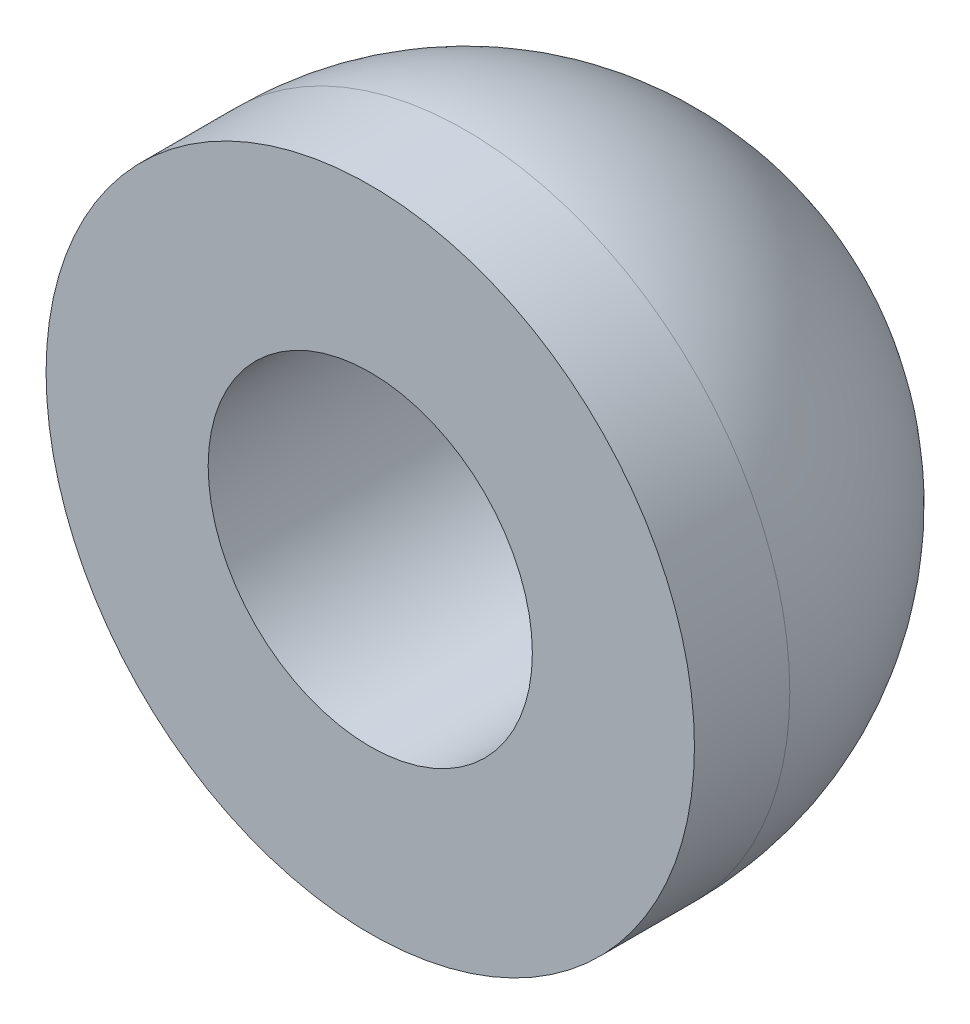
ISO-10303-21;
HEADER;
FILE_DESCRIPTION(('STEP AP214'),'2;1');
FILE_NAME('part.step','',(''),(''),'','','');
FILE_SCHEMA(('AUTOMOTIVE_DESIGN { 1 0 10303 214 1 1 1 1 }'));
ENDSEC;
DATA;
#1=APPLICATION_CONTEXT('core data for automotive mechanical design processes');
#2=APPLICATION_PROTOCOL_DEFINITION('international standard','automotive_design',2000,#1);
#3=PRODUCT_CONTEXT('',#1,'mechanical');
#4=PRODUCT('Part','Part','',(#3));
#5=PRODUCT_RELATED_PRODUCT_CATEGORY('part','',(#4));
#6=PRODUCT_DEFINITION_FORMATION('','',#4);
#7=PRODUCT_DEFINITION_CONTEXT('part definition',#1,'design');
#8=PRODUCT_DEFINITION('design','',#6,#7);
#9=PRODUCT_DEFINITION_SHAPE('','',#8);
#10=(LENGTH_UNIT() NAMED_UNIT(*) SI_UNIT(.MILLI.,.METRE.));
#11=(NAMED_UNIT(*) PLANE_ANGLE_UNIT() SI_UNIT($,.RADIAN.));
#12=(NAMED_UNIT(*) SI_UNIT($,.STERADIAN.) SOLID_ANGLE_UNIT());
#13=UNCERTAINTY_MEASURE_WITH_UNIT(LENGTH_MEASURE(1.E-05),#10,'distance_accuracy_value','');
#14=(GEOMETRIC_REPRESENTATION_CONTEXT(3) GLOBAL_UNCERTAINTY_ASSIGNED_CONTEXT((#13)) GLOBAL_UNIT_ASSIGNED_CONTEXT((#10,
#11,#12)) REPRESENTATION_CONTEXT('',''));
#15=CARTESIAN_POINT('',(0.,0.,0.));
#16=DIRECTION('',(0.,0.,1.));
#17=DIRECTION('',(1.,0.,0.));
#18=AXIS2_PLACEMENT_3D('',#15,#16,#17);
#19=CARTESIAN_POINT('',(0.,4.25,0.));
#20=DIRECTION('',(0.,0.,-1.));
#21=DIRECTION('',(-1.,0.,0.));
#22=AXIS2_PLACEMENT_3D('',#19,#20,#21);
#23=PLANE('',#22);
#24=CARTESIAN_POINT('',(0.,0.,0.));
#25=DIRECTION('',(0.,0.,1.));
#26=DIRECTION('',(1.,0.,0.));
#27=AXIS2_PLACEMENT_3D('',#24,#25,#26);
#28=CIRCLE('',#27,4.25);
#29=CARTESIAN_POINT('',(4.25,0.,0.));
#30=VERTEX_POINT('',#29);
#31=EDGE_CURVE('E10',#30,#30,#28,.T.);
#32=ORIENTED_EDGE('',*,*,#31,.F.);
#33=EDGE_LOOP('',(#32));
#34=FACE_BOUND('',#33,.T.);
#35=CARTESIAN_POINT('',(0.,0.,0.));
#36=DIRECTION('',(0.,0.,1.));
#37=DIRECTION('',(1.,0.,0.));
#38=AXIS2_PLACEMENT_3D('',#35,#36,#37);
#39=CIRCLE('',#38,8.5);
#40=CARTESIAN_POINT('',(8.5,0.,0.));
#41=VERTEX_POINT('',#40);
#42=EDGE_CURVE('E36',#41,#41,#39,.T.);
#43=ORIENTED_EDGE('',*,*,#42,.T.);
#44=EDGE_LOOP('',(#43));
#45=FACE_BOUND('',#44,.T.);
#46=ADVANCED_FACE('F25',(#34,#45),#23,.F.);
#47=CARTESIAN_POINT('',(0.,0.,0.));
#48=DIRECTION('',(0.,0.,1.));
#49=DIRECTION('',(1.,0.,0.));
#50=AXIS2_PLACEMENT_3D('',#47,#48,#49);
#51=CYLINDRICAL_SURFACE('',#50,4.25);
#52=CARTESIAN_POINT('',(0.,0.,-9.75));
#53=DIRECTION('',(0.,0.,1.));
#54=DIRECTION('',(1.,0.,0.));
#55=AXIS2_PLACEMENT_3D('',#52,#53,#54);
#56=CIRCLE('',#55,4.25);
#57=CARTESIAN_POINT('',(4.25,0.,-9.75));
#58=VERTEX_POINT('',#57);
#59=EDGE_CURVE('E41',#58,#58,#56,.F.);
#60=ORIENTED_EDGE('',*,*,#59,.T.);
#61=EDGE_LOOP('',(#60));
#62=FACE_BOUND('',#61,.T.);
#63=ORIENTED_EDGE('',*,*,#31,.T.);
#64=EDGE_LOOP('',(#63));
#65=FACE_BOUND('',#64,.T.);
#66=ADVANCED_FACE('F63',(#62,#65),#51,.F.);
#67=CARTESIAN_POINT('',(0.,0.,-2.5));
#68=DIRECTION('',(0.,0.,1.));
#69=DIRECTION('',(0.,1.,0.));
#70=AXIS2_PLACEMENT_3D('',#67,#68,#69);
#71=SPHERICAL_SURFACE('',#70,8.5);
#72=CARTESIAN_POINT('',(0.,0.,-9.75));
#73=DIRECTION('',(0.,0.,1.));
#74=DIRECTION('',(1.,0.,0.));
#75=AXIS2_PLACEMENT_3D('',#72,#73,#74);
#76=CIRCLE('',#75,4.43705983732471);
#77=CARTESIAN_POINT('',(4.43705983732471,0.,-9.75));
#78=VERTEX_POINT('',#77);
#79=EDGE_CURVE('E28',#78,#78,#76,.T.);
#80=ORIENTED_EDGE('',*,*,#79,.T.);
#81=EDGE_LOOP('',(#80));
#82=FACE_BOUND('',#81,.T.);
#83=CARTESIAN_POINT('',(0.,0.,-2.5));
#84=DIRECTION('',(0.,0.,1.));
#85=DIRECTION('',(1.,0.,0.));
#86=AXIS2_PLACEMENT_3D('',#83,#84,#85);
#87=CIRCLE('',#86,8.5);
#88=CARTESIAN_POINT('',(8.5,0.,-2.5));
#89=VERTEX_POINT('',#88);
#90=EDGE_CURVE('E32',#89,#89,#87,.T.);
#91=ORIENTED_EDGE('',*,*,#90,.F.);
#92=EDGE_LOOP('',(#91));
#93=FACE_BOUND('',#92,.T.);
#94=ADVANCED_FACE('F48',(#82,#93),#71,.T.);
#95=CARTESIAN_POINT('',(0.,0.,0.));
#96=DIRECTION('',(0.,0.,1.));
#97=DIRECTION('',(1.,0.,0.));
#98=AXIS2_PLACEMENT_3D('',#95,#96,#97);
#99=CYLINDRICAL_SURFACE('',#98,8.5);
#100=ORIENTED_EDGE('',*,*,#42,.F.);
#101=EDGE_LOOP('',(#100));
#102=FACE_BOUND('',#101,.T.);
#103=ORIENTED_EDGE('',*,*,#90,.T.);
#104=EDGE_LOOP('',(#103));
#105=FACE_BOUND('',#104,.T.);
#106=ADVANCED_FACE('F54',(#102,#105),#99,.T.);
#107=CARTESIAN_POINT('',(0.,0.,-9.75));
#108=DIRECTION('',(0.,0.,1.));
#109=DIRECTION('',(1.,0.,0.));
#110=AXIS2_PLACEMENT_3D('',#107,#108,#109);
#111=PLANE('',#110);
#112=ORIENTED_EDGE('',*,*,#79,.F.);
#113=EDGE_LOOP('',(#112));
#114=FACE_BOUND('',#113,.T.);
#115=ORIENTED_EDGE('',*,*,#59,.F.);
#116=EDGE_LOOP('',(#115));
#117=FACE_BOUND('',#116,.T.);
#118=ADVANCED_FACE('F51',(#114,#117),#111,.F.);
#119=CLOSED_SHELL('',(#46,#66,#94,#106,#118));
#120=MANIFOLD_SOLID_BREP('B2',#119);
#121=ADVANCED_BREP_SHAPE_REPRESENTATION('',(#18,#120),#14);
#122=SHAPE_DEFINITION_REPRESENTATION(#9,#121);
ENDSEC;
END-ISO-10303-21;
